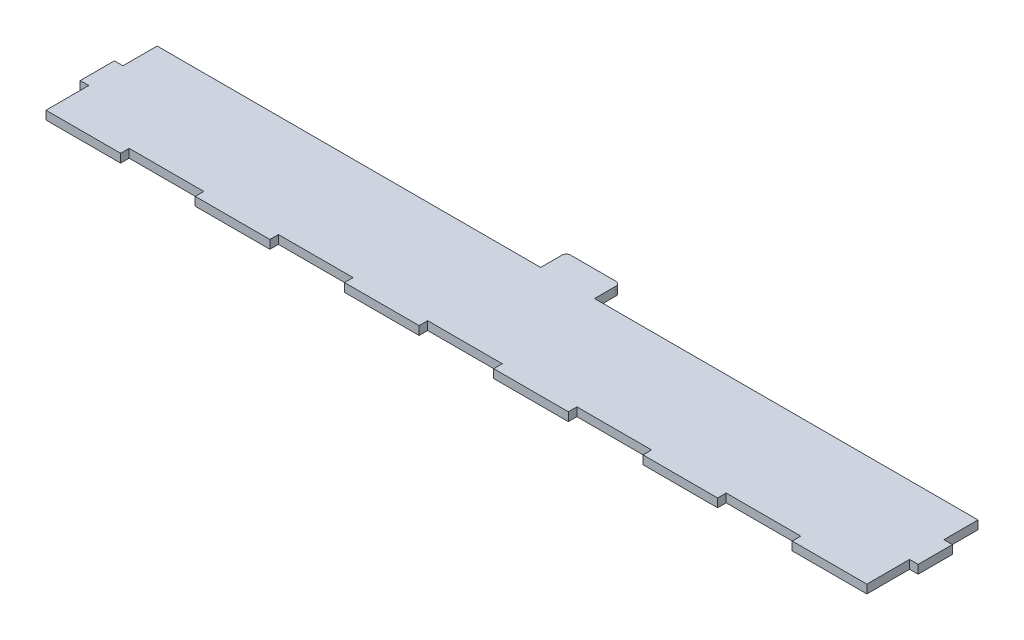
from build123d import *

# Parameters (mm, degrees)
BOSS_EXTRUDE1_DEPTH = 3.175


with BuildPart() as part:
    # Sketch1 → Boss-Extrude1 (new body)
    with BuildSketch(Plane(origin=(0, 0, 0), x_dir=(1, 0, 0), z_dir=(0, 1, 0))):
        with BuildLine():
            Line((-152.4, 38.1), (-10, 38.1))
            Line((-10, 38.1), (-10, 46.0375))
            ThreePointArc((-10, 46.0375), (-9.535032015, 47.160032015), (-8.4125, 47.625))
            Line((-8.4125, 47.625), (8.4125, 47.625))
            ThreePointArc((8.4125, 47.625), (9.535032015, 47.160032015), (10, 46.0375))
            Line((10, 46.0375), (10, 38.1))
            Line((10, 38.1), (152.4, 38.1))
            Line((152.4, 38.1), (152.4, 25.4))
            Line((152.4, 25.4), (155.575, 25.4))
            Line((155.575, 25.4), (155.575, 12.7))
            Line((155.575, 12.7), (152.4, 12.7))
            Line((152.4, 12.7), (152.4, -3.175))
            Line((152.4, -3.175), (124.690909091, -3.175))
            Line((124.690909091, -3.175), (124.690909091, 0))
            Line((124.690909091, 0), (96.981818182, 0))
            Line((96.981818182, 0), (96.981818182, -3.175))
            Line((96.981818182, -3.175), (69.272727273, -3.175))
            Line((69.272727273, -3.175), (69.272727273, 0))
            Line((69.272727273, 0), (41.563636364, 0))
            Line((41.563636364, 0), (41.563636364, -3.175))
            Line((41.563636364, -3.175), (13.854545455, -3.175))
            Line((13.854545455, -3.175), (13.854545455, 0))
            Line((13.854545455, 0), (-13.854545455, 0))
            Line((-13.854545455, 0), (-13.854545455, -3.175))
            Line((-13.854545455, -3.175), (-41.563636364, -3.175))
            Line((-41.563636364, -3.175), (-41.563636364, 0))
            Line((-41.563636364, 0), (-69.272727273, 0))
            Line((-69.272727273, 0), (-69.272727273, -3.175))
            Line((-69.272727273, -3.175), (-96.981818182, -3.175))
            Line((-96.981818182, -3.175), (-96.981818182, 0))
            Line((-96.981818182, 0), (-124.690909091, 0))
            Line((-124.690909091, 0), (-124.690909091, -3.175))
            Line((-124.690909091, -3.175), (-152.4, -3.175))
            Line((-152.4, -3.175), (-152.4, 12.7))
            Line((-152.4, 12.7), (-155.575, 12.7))
            Line((-155.575, 12.7), (-155.575, 25.4))
            Line((-155.575, 25.4), (-152.4, 25.4))
            Line((-152.4, 25.4), (-152.4, 38.1))
        make_face()
    extrude(amount=BOSS_EXTRUDE1_DEPTH)


solid = part.part
